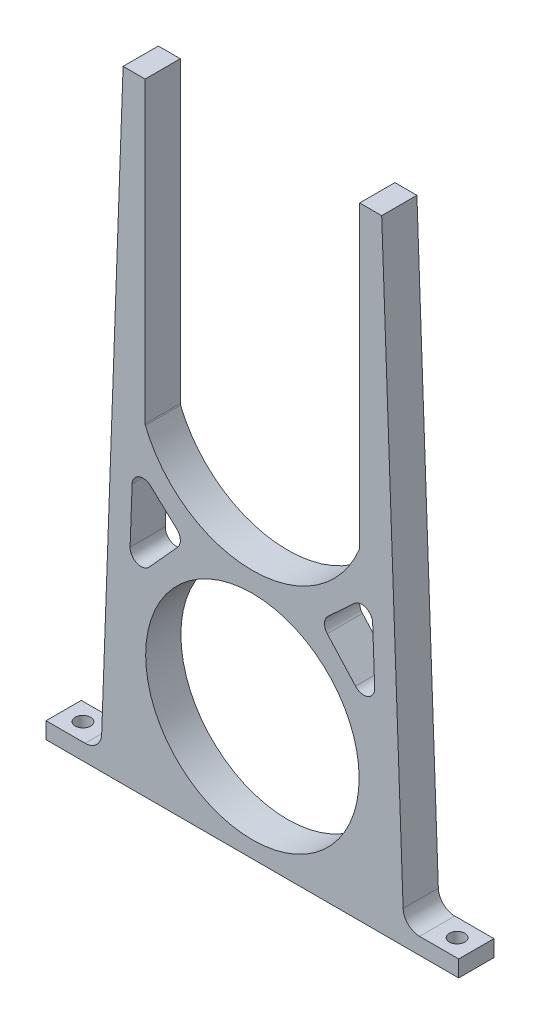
from build123d import *

# Parameters (mm, degrees)
SKETCH1_R            = 19.4
BOSS_EXTRUDE1_DEPTH  = 3.2
SKETCH2_W            = 1.4
SKETCH2_H            = 3
FILLET1_R            = 0.7
FILLET2_R            = 3
CUT_EXTRUDE1_DEPTH   = 5
FILLET3_R            = 2
FILLET3_OF_MIRROR2_R = 2


with BuildPart() as part:
    # Sketch1 → Boss-Extrude1 (new, symmetric)
    with BuildSketch(Plane.XY):
        with BuildLine():
            Line((-37.5, 0), (37.5, 0))
            Line((37.5, 0), (37.5, 3))
            Line((37.5, 3), (27.5, 3))
            Line((27.5, 3), (23.5, 113))
            Line((23.5, 113), (19.5, 113))
            Line((19.5, 113), (19.5, 58.605771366))
            ThreePointArc((19.5, 58.605771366), (0, 45.4), (-19.5, 58.605771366))
            Line((-19.5, 58.605771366), (-19.5, 113))
            Line((-19.5, 113), (-23.5, 113))
            Line((-23.5, 113), (-27.5, 3))
            Line((-27.5, 3), (-37.5, 3))
            Line((-37.5, 3), (-37.5, 0))
        make_face()
        with Locations(Location((0, 22.4, 0), (0, 0, 180))):
            Circle(SKETCH1_R, mode=Mode.SUBTRACT)
    extrude(amount=BOSS_EXTRUDE1_DEPTH, both=True)

    # Sketch2 → Cut-Revolve1 (revolve, cut)
    with BuildSketch(Plane.XY, mode=Mode.PRIVATE) as cut_revolve1_sk:
        with Locations((34.7, 1.5)):
            Rectangle(SKETCH2_W, SKETCH2_H)
    cut_revolve1 = revolve(cut_revolve1_sk.sketch.rotate(Axis((34, 3, 0), (0, -1, 0)), 90), axis=Axis((34, 3, 0), (0, -1, 0)), mode=Mode.SUBTRACT)

    # Mirror1: Cut-Revolve1 across plane
    add(cut_revolve1.mirror(Plane(origin=(0, 0, 0), x_dir=(0, 0, 1), z_dir=(1, 0, 0))), mode=Mode.SUBTRACT)

    # Fillet1
    fillet1_edges = [part.edges().sort_by_distance(p)[0] for p in [
        (-19.5, 58.605771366, 0),
        (19.5, 58.605771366, 0),
    ]]
    fillet(fillet1_edges, radius=FILLET1_R)

    # Fillet2
    fillet2_edges = [part.edges().sort_by_distance(p)[0] for p in [
        (27.5, 3, 0),
        (-27.5, 3, 0),
    ]]
    fillet(fillet2_edges, radius=FILLET2_R)

    # Sketch3 → Cut-Extrude1 (cut, symmetric)
    with BuildSketch(Plane.XY):
        Polygon((12.285988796, 43.70113052), (21.700071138, 52.425340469), (22.425001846, 32.489746), align=None)
    cut_extrude1 = extrude(amount=CUT_EXTRUDE1_DEPTH, both=True, mode=Mode.SUBTRACT)

    # Fillet3
    fillet3_edges = [part.edges().sort_by_distance(p)[0] for p in [
        (22.425001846, 32.489746, 0),
        (12.285988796, 43.70113052, 0),
        (21.700071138, 52.425340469, 0),
    ]]
    fillet(fillet3_edges, radius=FILLET3_R)

    # Mirror2: Cut-Extrude1 across plane
    add(cut_extrude1.mirror(Plane(origin=(0, 0, 0), x_dir=(0, 0, 1), z_dir=(1, 0, 0))), mode=Mode.SUBTRACT)

    # Fillet3 of Mirror2
    fillet3_of_mirror2_edges = [part.edges().sort_by_distance(p)[0] for p in [
        (-22.425001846, 32.489746, 0),
        (-12.285988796, 43.70113052, 0),
        (-21.700071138, 52.425340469, 0),
    ]]
    fillet(fillet3_of_mirror2_edges, radius=FILLET3_OF_MIRROR2_R)


solid = part.part
